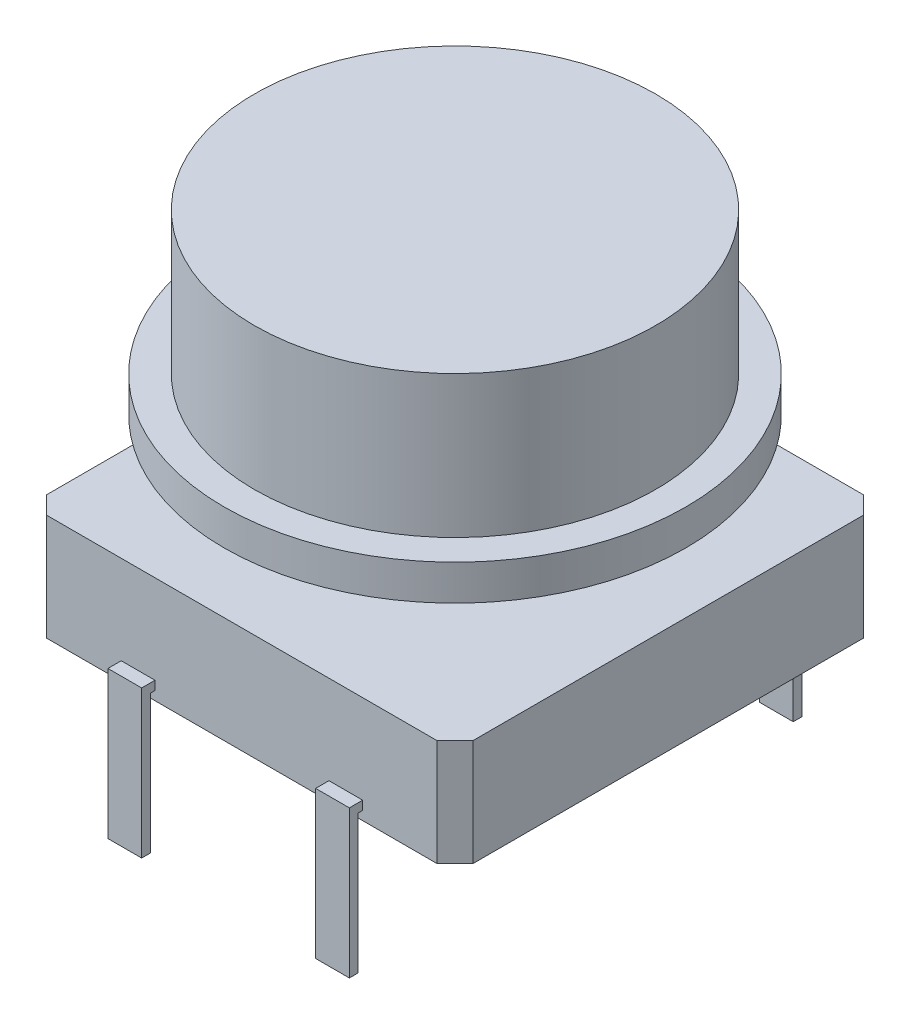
from build123d import *

# Parameters (mm, degrees)
BOSS_EXTRUDE1_DEPTH  = 3
SKETCH2_R            = 3.375
BOSS_EXTRUDE2_DEPTH  = 0.2
SKETCH3_W            = 3.5
SKETCH3_H            = 3.5
BOSS_EXTRUDE3_DEPTH  = 2
SKETCH4_R            = 6.5
BOSS_EXTRUDE4_DEPTH  = 1
SKETCH5_R            = 5.65
BOSS_EXTRUDE5_DEPTH  = 4
BOSS_EXTRUDE6_DEPTH  = 0.95
MIRROR2_COPY_1_DEPTH = 0.95


with BuildPart() as part:
    # Sketch1 → Boss-Extrude1 (new body)
    with BuildSketch(Plane(origin=(0, 0, 0), x_dir=(1, 0, 0), z_dir=(0, 1, 0))):
        Polygon((-5.5, 6), (-6, 5.5), (-6, -5.5), (-5.5, -6), (5.5, -6), (6, -5.5), (6, 5.5), (5.5, 6), align=None)
    extrude(amount=BOSS_EXTRUDE1_DEPTH)

    # Sketch2 → Boss-Extrude2 (add)
    with BuildSketch(Plane(origin=(0, 3, 0), x_dir=(1, 0, 0), z_dir=(0, 1, 0))):
        with Locations(Location((0, 0, 0), (0, 0, 270))):
            Circle(SKETCH2_R)
    extrude(amount=BOSS_EXTRUDE2_DEPTH)

    # Sketch3 → Boss-Extrude3 (add)
    with BuildSketch(Plane(origin=(0, 3.2, 0), x_dir=(1, 0, 0), z_dir=(0, 1, 0))):
        Rectangle(SKETCH3_W, SKETCH3_H)
    extrude(amount=BOSS_EXTRUDE3_DEPTH)

    # Sketch4 → Boss-Extrude4 (add)
    with BuildSketch(Plane(origin=(0, 5.2, 0), x_dir=(1, 0, 0), z_dir=(0, 1, 0))):
        with Locations(Location((0, 0, 0), (0, 0, 270))):
            Circle(SKETCH4_R)
    extrude(amount=BOSS_EXTRUDE4_DEPTH)

    # Sketch5 → Boss-Extrude5 (add)
    with BuildSketch(Plane(origin=(0, 6.2, 0), x_dir=(1, 0, 0), z_dir=(0, 1, 0))):
        with Locations(Location((0, 0, 0), (0, 0, 270))):
            Circle(SKETCH5_R)
    extrude(amount=BOSS_EXTRUDE5_DEPTH)

    # Sketch7 → Boss-Extrude6 (add)
    with BuildSketch(Plane.ZY.offset(3.4)):
        Polygon((6.375, 0.5), (6, 0.5), (6, 0.25), (6.125, 0.25), (6.125, -3.65), (6.375, -3.65), align=None)
    boss_extrude6 = extrude(amount=-BOSS_EXTRUDE6_DEPTH)

    # Mirror1: Boss-Extrude6 across plane
    add(boss_extrude6.mirror(Plane.ZY))

    # Mirror2: Boss-Extrude6 across plane
    add(boss_extrude6.mirror(Plane.XY))

    # Mirror2 copy 1 sketch → Mirror2 copy 1 (add)
    with BuildSketch(Plane(origin=(3.4, 0, 0), x_dir=(0, 0, -1), z_dir=(1, 0, 0))):
        Polygon((6.375, 0.5), (6, 0.5), (6, 0.25), (6.125, 0.25), (6.125, -3.65), (6.375, -3.65), align=None)
    extrude(amount=-MIRROR2_COPY_1_DEPTH)


solid = part.part
